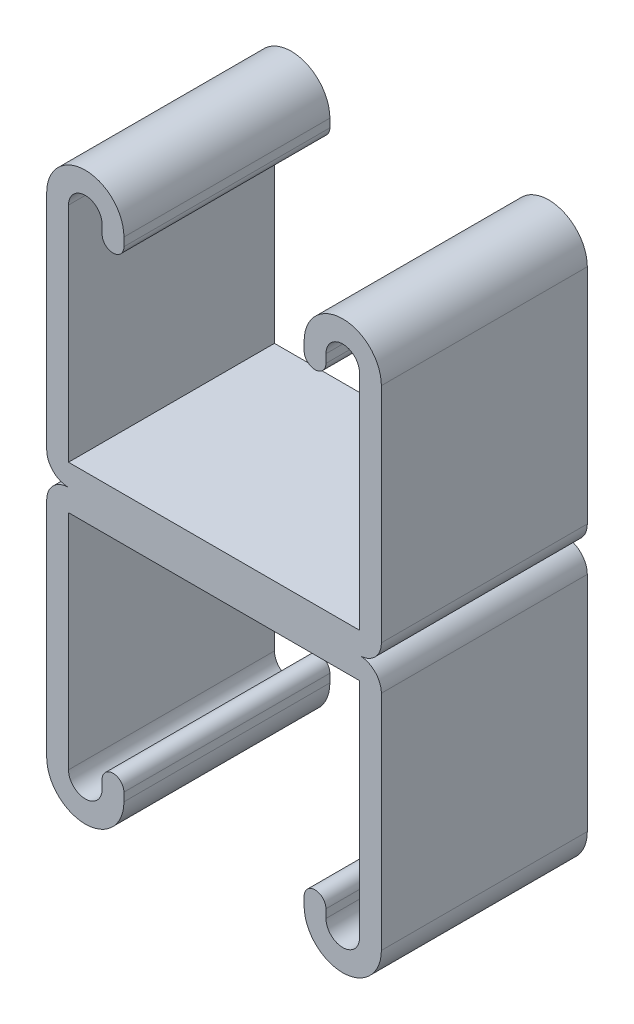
ISO-10303-21;
HEADER;
FILE_DESCRIPTION(('STEP AP214'),'2;1');
FILE_NAME('part.step','',(''),(''),'','','');
FILE_SCHEMA(('AUTOMOTIVE_DESIGN { 1 0 10303 214 1 1 1 1 }'));
ENDSEC;
DATA;
#1=APPLICATION_CONTEXT('core data for automotive mechanical design processes');
#2=APPLICATION_PROTOCOL_DEFINITION('international standard','automotive_design',2000,#1);
#3=PRODUCT_CONTEXT('',#1,'mechanical');
#4=PRODUCT('Part','Part','',(#3));
#5=PRODUCT_RELATED_PRODUCT_CATEGORY('part','',(#4));
#6=PRODUCT_DEFINITION_FORMATION('','',#4);
#7=PRODUCT_DEFINITION_CONTEXT('part definition',#1,'design');
#8=PRODUCT_DEFINITION('design','',#6,#7);
#9=PRODUCT_DEFINITION_SHAPE('','',#8);
#10=(LENGTH_UNIT() NAMED_UNIT(*) SI_UNIT(.MILLI.,.METRE.));
#11=(NAMED_UNIT(*) PLANE_ANGLE_UNIT() SI_UNIT($,.RADIAN.));
#12=(NAMED_UNIT(*) SI_UNIT($,.STERADIAN.) SOLID_ANGLE_UNIT());
#13=UNCERTAINTY_MEASURE_WITH_UNIT(LENGTH_MEASURE(1.E-05),#10,'distance_accuracy_value','');
#14=(GEOMETRIC_REPRESENTATION_CONTEXT(3) GLOBAL_UNCERTAINTY_ASSIGNED_CONTEXT((#13)) GLOBAL_UNIT_ASSIGNED_CONTEXT((#10,
#11,#12)) REPRESENTATION_CONTEXT('',''));
#15=CARTESIAN_POINT('',(0.,0.,0.));
#16=DIRECTION('',(0.,0.,1.));
#17=DIRECTION('',(1.,0.,0.));
#18=AXIS2_PLACEMENT_3D('',#15,#16,#17);
#19=CARTESIAN_POINT('',(-15.875,30.1625,12.7));
#20=DIRECTION('',(0.,0.,-1.));
#21=DIRECTION('',(-1.,0.,0.));
#22=AXIS2_PLACEMENT_3D('',#19,#20,#21);
#23=CYLINDRICAL_SURFACE('',#22,4.7625);
#24=CARTESIAN_POINT('',(-15.875,30.1625,-12.7));
#25=DIRECTION('',(0.,0.,1.));
#26=DIRECTION('',(-1.,0.,0.));
#27=AXIS2_PLACEMENT_3D('',#24,#25,#26);
#28=CIRCLE('',#27,4.7625);
#29=CARTESIAN_POINT('',(-11.1125,30.1625,-12.7));
#30=VERTEX_POINT('',#29);
#31=CARTESIAN_POINT('',(-20.6375,30.1625,-12.7));
#32=VERTEX_POINT('',#31);
#33=EDGE_CURVE('E196',#30,#32,#28,.T.);
#34=ORIENTED_EDGE('',*,*,#33,.T.);
#35=DIRECTION('',(0.,0.,-1.));
#36=VECTOR('',#35,1.);
#37=CARTESIAN_POINT('',(-20.6375,30.1625,12.7));
#38=LINE('',#37,#36);
#39=CARTESIAN_POINT('',(-20.6375,30.1625,12.7));
#40=VERTEX_POINT('',#39);
#41=EDGE_CURVE('E11',#40,#32,#38,.T.);
#42=ORIENTED_EDGE('',*,*,#41,.F.);
#43=CARTESIAN_POINT('',(-15.875,30.1625,12.7));
#44=DIRECTION('',(0.,0.,1.));
#45=DIRECTION('',(-1.,0.,0.));
#46=AXIS2_PLACEMENT_3D('',#43,#44,#45);
#47=CIRCLE('',#46,4.7625);
#48=CARTESIAN_POINT('',(-11.1125,30.1625,12.7));
#49=VERTEX_POINT('',#48);
#50=EDGE_CURVE('E229',#49,#40,#47,.T.);
#51=ORIENTED_EDGE('',*,*,#50,.F.);
#52=DIRECTION('',(0.,0.,-1.));
#53=VECTOR('',#52,1.);
#54=CARTESIAN_POINT('',(-11.1125,30.1625,12.7));
#55=LINE('',#54,#53);
#56=EDGE_CURVE('E192',#49,#30,#55,.T.);
#57=ORIENTED_EDGE('',*,*,#56,.T.);
#58=EDGE_LOOP('',(#34,#42,#51,#57));
#59=FACE_BOUND('',#58,.T.);
#60=ADVANCED_FACE('F39',(#59),#23,.T.);
#61=CARTESIAN_POINT('',(-20.6375,30.1625,12.7));
#62=DIRECTION('',(1.,0.,0.));
#63=DIRECTION('',(0.,1.,0.));
#64=AXIS2_PLACEMENT_3D('',#61,#62,#63);
#65=PLANE('',#64);
#66=DIRECTION('',(0.,-1.,0.));
#67=VECTOR('',#66,1.);
#68=CARTESIAN_POINT('',(-20.6375,30.1625,-12.7));
#69=LINE('',#68,#67);
#70=CARTESIAN_POINT('',(-20.6375,2.6924,-12.7));
#71=VERTEX_POINT('',#70);
#72=EDGE_CURVE('E199',#32,#71,#69,.T.);
#73=ORIENTED_EDGE('',*,*,#72,.T.);
#74=DIRECTION('',(0.,0.,-1.));
#75=VECTOR('',#74,1.);
#76=CARTESIAN_POINT('',(-20.6375,2.6924,12.7));
#77=LINE('',#76,#75);
#78=CARTESIAN_POINT('',(-20.6375,2.6924,12.7));
#79=VERTEX_POINT('',#78);
#80=EDGE_CURVE('E47',#79,#71,#77,.T.);
#81=ORIENTED_EDGE('',*,*,#80,.F.);
#82=DIRECTION('',(0.,-1.,0.));
#83=VECTOR('',#82,1.);
#84=CARTESIAN_POINT('',(-20.6375,30.1625,12.7));
#85=LINE('',#84,#83);
#86=EDGE_CURVE('E126',#40,#79,#85,.T.);
#87=ORIENTED_EDGE('',*,*,#86,.F.);
#88=ORIENTED_EDGE('',*,*,#41,.T.);
#89=EDGE_LOOP('',(#73,#81,#87,#88));
#90=FACE_BOUND('',#89,.T.);
#91=ADVANCED_FACE('F392',(#90),#65,.F.);
#92=CARTESIAN_POINT('',(-17.9451,2.6924,12.7));
#93=DIRECTION('',(0.,0.,-1.));
#94=DIRECTION('',(-1.,0.,0.));
#95=AXIS2_PLACEMENT_3D('',#92,#93,#94);
#96=CYLINDRICAL_SURFACE('',#95,2.6924);
#97=CARTESIAN_POINT('',(-17.9451,2.6924,-12.7));
#98=DIRECTION('',(0.,0.,1.));
#99=DIRECTION('',(-1.,0.,0.));
#100=AXIS2_PLACEMENT_3D('',#97,#98,#99);
#101=CIRCLE('',#100,2.6924);
#102=CARTESIAN_POINT('',(-17.9451,0.,-12.7));
#103=VERTEX_POINT('',#102);
#104=EDGE_CURVE('E202',#71,#103,#101,.T.);
#105=ORIENTED_EDGE('',*,*,#104,.T.);
#106=DIRECTION('',(0.,0.,-1.));
#107=VECTOR('',#106,1.);
#108=CARTESIAN_POINT('',(-17.9451,0.,12.7));
#109=LINE('',#108,#107);
#110=CARTESIAN_POINT('',(-17.9451,0.,12.7));
#111=VERTEX_POINT('',#110);
#112=EDGE_CURVE('E266',#111,#103,#109,.T.);
#113=ORIENTED_EDGE('',*,*,#112,.F.);
#114=CARTESIAN_POINT('',(-17.9451,2.6924,12.7));
#115=DIRECTION('',(0.,0.,1.));
#116=DIRECTION('',(-1.,0.,0.));
#117=AXIS2_PLACEMENT_3D('',#114,#115,#116);
#118=CIRCLE('',#117,2.6924);
#119=EDGE_CURVE('E274',#79,#111,#118,.T.);
#120=ORIENTED_EDGE('',*,*,#119,.F.);
#121=ORIENTED_EDGE('',*,*,#80,.T.);
#122=EDGE_LOOP('',(#105,#113,#120,#121));
#123=FACE_BOUND('',#122,.T.);
#124=ADVANCED_FACE('F272',(#123),#96,.T.);
#125=CARTESIAN_POINT('',(17.9451,2.69240000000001,12.7));
#126=DIRECTION('',(0.,0.,-1.));
#127=DIRECTION('',(-1.,0.,0.));
#128=AXIS2_PLACEMENT_3D('',#125,#126,#127);
#129=CYLINDRICAL_SURFACE('',#128,2.6924);
#130=CARTESIAN_POINT('',(17.9451,2.69240000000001,-12.7));
#131=DIRECTION('',(0.,0.,1.));
#132=DIRECTION('',(1.,0.,0.));
#133=AXIS2_PLACEMENT_3D('',#130,#131,#132);
#134=CIRCLE('',#133,2.6924);
#135=CARTESIAN_POINT('',(17.9451,0.,-12.7));
#136=VERTEX_POINT('',#135);
#137=CARTESIAN_POINT('',(20.6375,2.69240000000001,-12.7));
#138=VERTEX_POINT('',#137);
#139=EDGE_CURVE('E204',#136,#138,#134,.T.);
#140=ORIENTED_EDGE('',*,*,#139,.T.);
#141=DIRECTION('',(0.,0.,-1.));
#142=VECTOR('',#141,1.);
#143=CARTESIAN_POINT('',(20.6375,2.69240000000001,12.7));
#144=LINE('',#143,#142);
#145=CARTESIAN_POINT('',(20.6375,2.69240000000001,12.7));
#146=VERTEX_POINT('',#145);
#147=EDGE_CURVE('E260',#146,#138,#144,.T.);
#148=ORIENTED_EDGE('',*,*,#147,.F.);
#149=CARTESIAN_POINT('',(17.9451,2.69240000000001,12.7));
#150=DIRECTION('',(0.,0.,1.));
#151=DIRECTION('',(1.,0.,0.));
#152=AXIS2_PLACEMENT_3D('',#149,#150,#151);
#153=CIRCLE('',#152,2.6924);
#154=CARTESIAN_POINT('',(17.9451,0.,12.7));
#155=VERTEX_POINT('',#154);
#156=EDGE_CURVE('E348',#155,#146,#153,.T.);
#157=ORIENTED_EDGE('',*,*,#156,.F.);
#158=DIRECTION('',(0.,0.,-1.));
#159=VECTOR('',#158,1.);
#160=CARTESIAN_POINT('',(17.9451,0.,12.7));
#161=LINE('',#160,#159);
#162=EDGE_CURVE('E263',#155,#136,#161,.T.);
#163=ORIENTED_EDGE('',*,*,#162,.T.);
#164=EDGE_LOOP('',(#140,#148,#157,#163));
#165=FACE_BOUND('',#164,.T.);
#166=ADVANCED_FACE('F399',(#165),#129,.T.);
#167=CARTESIAN_POINT('',(20.6375,2.69240000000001,12.7));
#168=DIRECTION('',(-1.,0.,0.));
#169=DIRECTION('',(0.,-1.,0.));
#170=AXIS2_PLACEMENT_3D('',#167,#168,#169);
#171=PLANE('',#170);
#172=DIRECTION('',(0.,1.,0.));
#173=VECTOR('',#172,1.);
#174=CARTESIAN_POINT('',(20.6375,2.69240000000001,-12.7));
#175=LINE('',#174,#173);
#176=CARTESIAN_POINT('',(20.6375,30.1625,-12.7));
#177=VERTEX_POINT('',#176);
#178=EDGE_CURVE('E206',#138,#177,#175,.T.);
#179=ORIENTED_EDGE('',*,*,#178,.T.);
#180=DIRECTION('',(0.,0.,-1.));
#181=VECTOR('',#180,1.);
#182=CARTESIAN_POINT('',(20.6375,30.1625,12.7));
#183=LINE('',#182,#181);
#184=CARTESIAN_POINT('',(20.6375,30.1625,12.7));
#185=VERTEX_POINT('',#184);
#186=EDGE_CURVE('E257',#185,#177,#183,.T.);
#187=ORIENTED_EDGE('',*,*,#186,.F.);
#188=DIRECTION('',(0.,1.,0.));
#189=VECTOR('',#188,1.);
#190=CARTESIAN_POINT('',(20.6375,2.69240000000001,12.7));
#191=LINE('',#190,#189);
#192=EDGE_CURVE('E350',#146,#185,#191,.T.);
#193=ORIENTED_EDGE('',*,*,#192,.F.);
#194=ORIENTED_EDGE('',*,*,#147,.T.);
#195=EDGE_LOOP('',(#179,#187,#193,#194));
#196=FACE_BOUND('',#195,.T.);
#197=ADVANCED_FACE('F404',(#196),#171,.F.);
#198=CARTESIAN_POINT('',(15.875,30.1625,12.7));
#199=DIRECTION('',(0.,0.,-1.));
#200=DIRECTION('',(-1.,0.,0.));
#201=AXIS2_PLACEMENT_3D('',#198,#199,#200);
#202=CYLINDRICAL_SURFACE('',#201,4.7625);
#203=CARTESIAN_POINT('',(15.875,30.1625,-12.7));
#204=DIRECTION('',(0.,0.,1.));
#205=DIRECTION('',(1.,0.,0.));
#206=AXIS2_PLACEMENT_3D('',#203,#204,#205);
#207=CIRCLE('',#206,4.7625);
#208=CARTESIAN_POINT('',(11.1125,30.1625,-12.7));
#209=VERTEX_POINT('',#208);
#210=EDGE_CURVE('E208',#177,#209,#207,.T.);
#211=ORIENTED_EDGE('',*,*,#210,.T.);
#212=DIRECTION('',(0.,0.,-1.));
#213=VECTOR('',#212,1.);
#214=CARTESIAN_POINT('',(11.1125,30.1625,12.7));
#215=LINE('',#214,#213);
#216=CARTESIAN_POINT('',(11.1125,30.1625,12.7));
#217=VERTEX_POINT('',#216);
#218=EDGE_CURVE('E254',#217,#209,#215,.T.);
#219=ORIENTED_EDGE('',*,*,#218,.F.);
#220=CARTESIAN_POINT('',(15.875,30.1625,12.7));
#221=DIRECTION('',(0.,0.,1.));
#222=DIRECTION('',(1.,0.,0.));
#223=AXIS2_PLACEMENT_3D('',#220,#221,#222);
#224=CIRCLE('',#223,4.7625);
#225=EDGE_CURVE('E352',#185,#217,#224,.T.);
#226=ORIENTED_EDGE('',*,*,#225,.F.);
#227=ORIENTED_EDGE('',*,*,#186,.T.);
#228=EDGE_LOOP('',(#211,#219,#226,#227));
#229=FACE_BOUND('',#228,.T.);
#230=ADVANCED_FACE('F407',(#229),#202,.T.);
#231=CARTESIAN_POINT('',(11.1125,30.1625,12.7));
#232=DIRECTION('',(1.,0.,0.));
#233=DIRECTION('',(0.,1.,0.));
#234=AXIS2_PLACEMENT_3D('',#231,#232,#233);
#235=PLANE('',#234);
#236=DIRECTION('',(0.,-1.,0.));
#237=VECTOR('',#236,1.);
#238=CARTESIAN_POINT('',(11.1125,30.1625,-12.7));
#239=LINE('',#238,#237);
#240=CARTESIAN_POINT('',(11.1125,29.12745,-12.7));
#241=VERTEX_POINT('',#240);
#242=EDGE_CURVE('E210',#209,#241,#239,.T.);
#243=ORIENTED_EDGE('',*,*,#242,.T.);
#244=DIRECTION('',(0.,0.,-1.));
#245=VECTOR('',#244,1.);
#246=CARTESIAN_POINT('',(11.1125,29.12745,12.7));
#247=LINE('',#246,#245);
#248=CARTESIAN_POINT('',(11.1125,29.12745,12.7));
#249=VERTEX_POINT('',#248);
#250=EDGE_CURVE('E251',#249,#241,#247,.T.);
#251=ORIENTED_EDGE('',*,*,#250,.F.);
#252=DIRECTION('',(0.,-1.,0.));
#253=VECTOR('',#252,1.);
#254=CARTESIAN_POINT('',(11.1125,30.1625,12.7));
#255=LINE('',#254,#253);
#256=EDGE_CURVE('E354',#217,#249,#255,.T.);
#257=ORIENTED_EDGE('',*,*,#256,.F.);
#258=ORIENTED_EDGE('',*,*,#218,.T.);
#259=EDGE_LOOP('',(#243,#251,#257,#258));
#260=FACE_BOUND('',#259,.T.);
#261=ADVANCED_FACE('F411',(#260),#235,.F.);
#262=CARTESIAN_POINT('',(12.4587,29.12745,12.7));
#263=DIRECTION('',(0.,0.,-1.));
#264=DIRECTION('',(-1.,0.,0.));
#265=AXIS2_PLACEMENT_3D('',#262,#263,#264);
#266=CYLINDRICAL_SURFACE('',#265,1.3462);
#267=CARTESIAN_POINT('',(12.4587,29.12745,-12.7));
#268=DIRECTION('',(0.,0.,1.));
#269=DIRECTION('',(1.,0.,0.));
#270=AXIS2_PLACEMENT_3D('',#267,#268,#269);
#271=CIRCLE('',#270,1.3462);
#272=CARTESIAN_POINT('',(13.8049,29.12745,-12.7));
#273=VERTEX_POINT('',#272);
#274=EDGE_CURVE('E212',#241,#273,#271,.T.);
#275=ORIENTED_EDGE('',*,*,#274,.T.);
#276=DIRECTION('',(0.,0.,-1.));
#277=VECTOR('',#276,1.);
#278=CARTESIAN_POINT('',(13.8049,29.12745,12.7));
#279=LINE('',#278,#277);
#280=CARTESIAN_POINT('',(13.8049,29.12745,12.7));
#281=VERTEX_POINT('',#280);
#282=EDGE_CURVE('E248',#281,#273,#279,.T.);
#283=ORIENTED_EDGE('',*,*,#282,.F.);
#284=CARTESIAN_POINT('',(12.4587,29.12745,12.7));
#285=DIRECTION('',(0.,0.,1.));
#286=DIRECTION('',(1.,0.,0.));
#287=AXIS2_PLACEMENT_3D('',#284,#285,#286);
#288=CIRCLE('',#287,1.3462);
#289=EDGE_CURVE('E356',#249,#281,#288,.T.);
#290=ORIENTED_EDGE('',*,*,#289,.F.);
#291=ORIENTED_EDGE('',*,*,#250,.T.);
#292=EDGE_LOOP('',(#275,#283,#290,#291));
#293=FACE_BOUND('',#292,.T.);
#294=ADVANCED_FACE('F415',(#293),#266,.T.);
#295=CARTESIAN_POINT('',(13.8049,30.1625,12.7));
#296=DIRECTION('',(-1.,0.,0.));
#297=DIRECTION('',(0.,0.,1.));
#298=AXIS2_PLACEMENT_3D('',#295,#296,#297);
#299=PLANE('',#298);
#300=DIRECTION('',(0.,1.,0.));
#301=VECTOR('',#300,1.);
#302=CARTESIAN_POINT('',(13.8049,30.1625,-12.7));
#303=LINE('',#302,#301);
#304=CARTESIAN_POINT('',(13.8049,30.1625,-12.7));
#305=VERTEX_POINT('',#304);
#306=EDGE_CURVE('E214',#273,#305,#303,.T.);
#307=ORIENTED_EDGE('',*,*,#306,.T.);
#308=DIRECTION('',(0.,0.,-1.));
#309=VECTOR('',#308,1.);
#310=CARTESIAN_POINT('',(13.8049,30.1625,12.7));
#311=LINE('',#310,#309);
#312=CARTESIAN_POINT('',(13.8049,30.1625,12.7));
#313=VERTEX_POINT('',#312);
#314=EDGE_CURVE('E245',#313,#305,#311,.T.);
#315=ORIENTED_EDGE('',*,*,#314,.F.);
#316=DIRECTION('',(0.,1.,0.));
#317=VECTOR('',#316,1.);
#318=CARTESIAN_POINT('',(13.8049,30.1625,12.7));
#319=LINE('',#318,#317);
#320=EDGE_CURVE('E358',#281,#313,#319,.T.);
#321=ORIENTED_EDGE('',*,*,#320,.F.);
#322=ORIENTED_EDGE('',*,*,#282,.T.);
#323=EDGE_LOOP('',(#307,#315,#321,#322));
#324=FACE_BOUND('',#323,.T.);
#325=ADVANCED_FACE('F419',(#324),#299,.F.);
#326=CARTESIAN_POINT('',(15.875,30.1625,12.7));
#327=DIRECTION('',(0.,0.,-1.));
#328=DIRECTION('',(-1.,0.,0.));
#329=AXIS2_PLACEMENT_3D('',#326,#327,#328);
#330=CYLINDRICAL_SURFACE('',#329,2.0701);
#331=CARTESIAN_POINT('',(15.875,30.1625,-12.7));
#332=DIRECTION('',(0.,0.,-1.));
#333=DIRECTION('',(1.,0.,0.));
#334=AXIS2_PLACEMENT_3D('',#331,#332,#333);
#335=CIRCLE('',#334,2.0701);
#336=CARTESIAN_POINT('',(17.9451,30.1625,-12.7));
#337=VERTEX_POINT('',#336);
#338=EDGE_CURVE('E216',#305,#337,#335,.T.);
#339=ORIENTED_EDGE('',*,*,#338,.T.);
#340=DIRECTION('',(0.,0.,-1.));
#341=VECTOR('',#340,1.);
#342=CARTESIAN_POINT('',(17.9451,30.1625,12.7));
#343=LINE('',#342,#341);
#344=CARTESIAN_POINT('',(17.9451,30.1625,12.7));
#345=VERTEX_POINT('',#344);
#346=EDGE_CURVE('E242',#345,#337,#343,.T.);
#347=ORIENTED_EDGE('',*,*,#346,.F.);
#348=CARTESIAN_POINT('',(15.875,30.1625,12.7));
#349=DIRECTION('',(0.,0.,-1.));
#350=DIRECTION('',(1.,0.,0.));
#351=AXIS2_PLACEMENT_3D('',#348,#349,#350);
#352=CIRCLE('',#351,2.0701);
#353=EDGE_CURVE('E360',#313,#345,#352,.T.);
#354=ORIENTED_EDGE('',*,*,#353,.F.);
#355=ORIENTED_EDGE('',*,*,#314,.T.);
#356=EDGE_LOOP('',(#339,#347,#354,#355));
#357=FACE_BOUND('',#356,.T.);
#358=ADVANCED_FACE('F423',(#357),#330,.F.);
#359=CARTESIAN_POINT('',(17.9451,2.6924,12.7));
#360=DIRECTION('',(1.,0.,0.));
#361=DIRECTION('',(0.,0.,-1.));
#362=AXIS2_PLACEMENT_3D('',#359,#360,#361);
#363=PLANE('',#362);
#364=DIRECTION('',(0.,-1.,0.));
#365=VECTOR('',#364,1.);
#366=CARTESIAN_POINT('',(17.9451,2.6924,-12.7));
#367=LINE('',#366,#365);
#368=CARTESIAN_POINT('',(17.9451,2.6924,-12.7));
#369=VERTEX_POINT('',#368);
#370=EDGE_CURVE('E218',#337,#369,#367,.T.);
#371=ORIENTED_EDGE('',*,*,#370,.T.);
#372=DIRECTION('',(0.,0.,-1.));
#373=VECTOR('',#372,1.);
#374=CARTESIAN_POINT('',(17.9451,2.6924,12.7));
#375=LINE('',#374,#373);
#376=CARTESIAN_POINT('',(17.9451,2.6924,12.7));
#377=VERTEX_POINT('',#376);
#378=EDGE_CURVE('E239',#377,#369,#375,.T.);
#379=ORIENTED_EDGE('',*,*,#378,.F.);
#380=DIRECTION('',(0.,-1.,0.));
#381=VECTOR('',#380,1.);
#382=CARTESIAN_POINT('',(17.9451,2.6924,12.7));
#383=LINE('',#382,#381);
#384=EDGE_CURVE('E362',#345,#377,#383,.T.);
#385=ORIENTED_EDGE('',*,*,#384,.F.);
#386=ORIENTED_EDGE('',*,*,#346,.T.);
#387=EDGE_LOOP('',(#371,#379,#385,#386));
#388=FACE_BOUND('',#387,.T.);
#389=ADVANCED_FACE('F427',(#388),#363,.F.);
#390=CARTESIAN_POINT('',(-17.9451,2.6924,12.7));
#391=DIRECTION('',(0.,-1.,0.));
#392=DIRECTION('',(0.,0.,-1.));
#393=AXIS2_PLACEMENT_3D('',#390,#391,#392);
#394=PLANE('',#393);
#395=DIRECTION('',(-1.,0.,0.));
#396=VECTOR('',#395,1.);
#397=CARTESIAN_POINT('',(-17.9451,2.6924,-12.7));
#398=LINE('',#397,#396);
#399=CARTESIAN_POINT('',(-17.9451,2.6924,-12.7));
#400=VERTEX_POINT('',#399);
#401=EDGE_CURVE('E220',#369,#400,#398,.T.);
#402=ORIENTED_EDGE('',*,*,#401,.T.);
#403=DIRECTION('',(0.,0.,-1.));
#404=VECTOR('',#403,1.);
#405=CARTESIAN_POINT('',(-17.9451,2.6924,12.7));
#406=LINE('',#405,#404);
#407=CARTESIAN_POINT('',(-17.9451,2.6924,12.7));
#408=VERTEX_POINT('',#407);
#409=EDGE_CURVE('E236',#408,#400,#406,.T.);
#410=ORIENTED_EDGE('',*,*,#409,.F.);
#411=DIRECTION('',(-1.,0.,0.));
#412=VECTOR('',#411,1.);
#413=CARTESIAN_POINT('',(-17.9451,2.6924,12.7));
#414=LINE('',#413,#412);
#415=EDGE_CURVE('E364',#377,#408,#414,.T.);
#416=ORIENTED_EDGE('',*,*,#415,.F.);
#417=ORIENTED_EDGE('',*,*,#378,.T.);
#418=EDGE_LOOP('',(#402,#410,#416,#417));
#419=FACE_BOUND('',#418,.T.);
#420=ADVANCED_FACE('F431',(#419),#394,.F.);
#421=CARTESIAN_POINT('',(-17.9451,30.1625,12.7));
#422=DIRECTION('',(-1.,0.,0.));
#423=DIRECTION('',(0.,-1.,0.));
#424=AXIS2_PLACEMENT_3D('',#421,#422,#423);
#425=PLANE('',#424);
#426=DIRECTION('',(0.,1.,0.));
#427=VECTOR('',#426,1.);
#428=CARTESIAN_POINT('',(-17.9451,30.1625,-12.7));
#429=LINE('',#428,#427);
#430=CARTESIAN_POINT('',(-17.9451,30.1625,-12.7));
#431=VERTEX_POINT('',#430);
#432=EDGE_CURVE('E222',#400,#431,#429,.T.);
#433=ORIENTED_EDGE('',*,*,#432,.T.);
#434=DIRECTION('',(0.,0.,-1.));
#435=VECTOR('',#434,1.);
#436=CARTESIAN_POINT('',(-17.9451,30.1625,12.7));
#437=LINE('',#436,#435);
#438=CARTESIAN_POINT('',(-17.9451,30.1625,12.7));
#439=VERTEX_POINT('',#438);
#440=EDGE_CURVE('E233',#439,#431,#437,.T.);
#441=ORIENTED_EDGE('',*,*,#440,.F.);
#442=DIRECTION('',(0.,1.,0.));
#443=VECTOR('',#442,1.);
#444=CARTESIAN_POINT('',(-17.9451,30.1625,12.7));
#445=LINE('',#444,#443);
#446=EDGE_CURVE('E366',#408,#439,#445,.T.);
#447=ORIENTED_EDGE('',*,*,#446,.F.);
#448=ORIENTED_EDGE('',*,*,#409,.T.);
#449=EDGE_LOOP('',(#433,#441,#447,#448));
#450=FACE_BOUND('',#449,.T.);
#451=ADVANCED_FACE('F372',(#450),#425,.F.);
#452=CARTESIAN_POINT('',(-15.875,30.1625,12.7));
#453=DIRECTION('',(0.,0.,-1.));
#454=DIRECTION('',(-1.,0.,0.));
#455=AXIS2_PLACEMENT_3D('',#452,#453,#454);
#456=CYLINDRICAL_SURFACE('',#455,2.0701);
#457=CARTESIAN_POINT('',(-15.875,30.1625,-12.7));
#458=DIRECTION('',(0.,0.,-1.));
#459=DIRECTION('',(-1.,0.,0.));
#460=AXIS2_PLACEMENT_3D('',#457,#458,#459);
#461=CIRCLE('',#460,2.0701);
#462=CARTESIAN_POINT('',(-13.8049,30.1625,-12.7));
#463=VERTEX_POINT('',#462);
#464=EDGE_CURVE('E224',#431,#463,#461,.T.);
#465=ORIENTED_EDGE('',*,*,#464,.T.);
#466=DIRECTION('',(0.,0.,-1.));
#467=VECTOR('',#466,1.);
#468=CARTESIAN_POINT('',(-13.8049,30.1625,12.7));
#469=LINE('',#468,#467);
#470=CARTESIAN_POINT('',(-13.8049,30.1625,12.7));
#471=VERTEX_POINT('',#470);
#472=EDGE_CURVE('E187',#471,#463,#469,.T.);
#473=ORIENTED_EDGE('',*,*,#472,.F.);
#474=CARTESIAN_POINT('',(-15.875,30.1625,12.7));
#475=DIRECTION('',(0.,0.,-1.));
#476=DIRECTION('',(-1.,0.,0.));
#477=AXIS2_PLACEMENT_3D('',#474,#475,#476);
#478=CIRCLE('',#477,2.0701);
#479=EDGE_CURVE('E178',#439,#471,#478,.T.);
#480=ORIENTED_EDGE('',*,*,#479,.F.);
#481=ORIENTED_EDGE('',*,*,#440,.T.);
#482=EDGE_LOOP('',(#465,#473,#480,#481));
#483=FACE_BOUND('',#482,.T.);
#484=ADVANCED_FACE('F376',(#483),#456,.F.);
#485=CARTESIAN_POINT('',(-13.8049,30.1625,12.7));
#486=DIRECTION('',(1.,0.,0.));
#487=DIRECTION('',(0.,0.,-1.));
#488=AXIS2_PLACEMENT_3D('',#485,#486,#487);
#489=PLANE('',#488);
#490=DIRECTION('',(0.,-1.,0.));
#491=VECTOR('',#490,1.);
#492=CARTESIAN_POINT('',(-13.8049,30.1625,-12.7));
#493=LINE('',#492,#491);
#494=CARTESIAN_POINT('',(-13.8049,29.12745,-12.7));
#495=VERTEX_POINT('',#494);
#496=EDGE_CURVE('E186',#463,#495,#493,.T.);
#497=ORIENTED_EDGE('',*,*,#496,.T.);
#498=DIRECTION('',(0.,0.,-1.));
#499=VECTOR('',#498,1.);
#500=CARTESIAN_POINT('',(-13.8049,29.12745,12.7));
#501=LINE('',#500,#499);
#502=CARTESIAN_POINT('',(-13.8049,29.12745,12.7));
#503=VERTEX_POINT('',#502);
#504=EDGE_CURVE('E183',#503,#495,#501,.T.);
#505=ORIENTED_EDGE('',*,*,#504,.F.);
#506=DIRECTION('',(0.,-1.,0.));
#507=VECTOR('',#506,1.);
#508=CARTESIAN_POINT('',(-13.8049,30.1625,12.7));
#509=LINE('',#508,#507);
#510=EDGE_CURVE('E172',#471,#503,#509,.T.);
#511=ORIENTED_EDGE('',*,*,#510,.F.);
#512=ORIENTED_EDGE('',*,*,#472,.T.);
#513=EDGE_LOOP('',(#497,#505,#511,#512));
#514=FACE_BOUND('',#513,.T.);
#515=ADVANCED_FACE('F184',(#514),#489,.F.);
#516=CARTESIAN_POINT('',(-12.4587,29.12745,12.7));
#517=DIRECTION('',(0.,0.,-1.));
#518=DIRECTION('',(-1.,0.,0.));
#519=AXIS2_PLACEMENT_3D('',#516,#517,#518);
#520=CYLINDRICAL_SURFACE('',#519,1.3462);
#521=CARTESIAN_POINT('',(-12.4587,29.12745,-12.7));
#522=DIRECTION('',(0.,0.,1.));
#523=DIRECTION('',(-1.,0.,0.));
#524=AXIS2_PLACEMENT_3D('',#521,#522,#523);
#525=CIRCLE('',#524,1.3462);
#526=CARTESIAN_POINT('',(-11.1125,29.12745,-12.7));
#527=VERTEX_POINT('',#526);
#528=EDGE_CURVE('E112',#495,#527,#525,.T.);
#529=ORIENTED_EDGE('',*,*,#528,.T.);
#530=DIRECTION('',(0.,0.,-1.));
#531=VECTOR('',#530,1.);
#532=CARTESIAN_POINT('',(-11.1125,29.12745,12.7));
#533=LINE('',#532,#531);
#534=CARTESIAN_POINT('',(-11.1125,29.12745,12.7));
#535=VERTEX_POINT('',#534);
#536=EDGE_CURVE('E188',#535,#527,#533,.T.);
#537=ORIENTED_EDGE('',*,*,#536,.F.);
#538=CARTESIAN_POINT('',(-12.4587,29.12745,12.7));
#539=DIRECTION('',(0.,0.,1.));
#540=DIRECTION('',(-1.,0.,0.));
#541=AXIS2_PLACEMENT_3D('',#538,#539,#540);
#542=CIRCLE('',#541,1.3462);
#543=EDGE_CURVE('E176',#503,#535,#542,.T.);
#544=ORIENTED_EDGE('',*,*,#543,.F.);
#545=ORIENTED_EDGE('',*,*,#504,.T.);
#546=EDGE_LOOP('',(#529,#537,#544,#545));
#547=FACE_BOUND('',#546,.T.);
#548=ADVANCED_FACE('F190',(#547),#520,.T.);
#549=CARTESIAN_POINT('',(-11.1125,30.1625,12.7));
#550=DIRECTION('',(-1.,0.,0.));
#551=DIRECTION('',(0.,-1.,0.));
#552=AXIS2_PLACEMENT_3D('',#549,#550,#551);
#553=PLANE('',#552);
#554=DIRECTION('',(0.,1.,0.));
#555=VECTOR('',#554,1.);
#556=CARTESIAN_POINT('',(-11.1125,30.1625,-12.7));
#557=LINE('',#556,#555);
#558=EDGE_CURVE('E118',#527,#30,#557,.T.);
#559=ORIENTED_EDGE('',*,*,#558,.T.);
#560=ORIENTED_EDGE('',*,*,#56,.F.);
#561=DIRECTION('',(0.,1.,0.));
#562=VECTOR('',#561,1.);
#563=CARTESIAN_POINT('',(-11.1125,30.1625,12.7));
#564=LINE('',#563,#562);
#565=EDGE_CURVE('E55',#535,#49,#564,.T.);
#566=ORIENTED_EDGE('',*,*,#565,.F.);
#567=ORIENTED_EDGE('',*,*,#536,.T.);
#568=EDGE_LOOP('',(#559,#560,#566,#567));
#569=FACE_BOUND('',#568,.T.);
#570=ADVANCED_FACE('F380',(#569),#553,.F.);
#571=CARTESIAN_POINT('',(-15.875,30.1625,12.7));
#572=DIRECTION('',(0.,0.,-1.));
#573=DIRECTION('',(-1.,0.,0.));
#574=AXIS2_PLACEMENT_3D('',#571,#572,#573);
#575=PLANE('',#574);
#576=ORIENTED_EDGE('',*,*,#50,.T.);
#577=ORIENTED_EDGE('',*,*,#86,.T.);
#578=ORIENTED_EDGE('',*,*,#119,.T.);
#579=CARTESIAN_POINT('',(-17.9451,-2.6924,12.7));
#580=DIRECTION('',(0.,0.,-1.));
#581=DIRECTION('',(-1.,0.,0.));
#582=AXIS2_PLACEMENT_3D('',#579,#580,#581);
#583=CIRCLE('',#582,2.6924);
#584=CARTESIAN_POINT('',(-20.6375,-2.6924,12.7));
#585=VERTEX_POINT('',#584);
#586=EDGE_CURVE('E779',#585,#111,#583,.T.);
#587=ORIENTED_EDGE('',*,*,#586,.F.);
#588=DIRECTION('',(0.,1.,0.));
#589=VECTOR('',#588,1.);
#590=CARTESIAN_POINT('',(-20.6375,-30.1625,12.7));
#591=LINE('',#590,#589);
#592=CARTESIAN_POINT('',(-20.6375,-30.1625,12.7));
#593=VERTEX_POINT('',#592);
#594=EDGE_CURVE('E301',#593,#585,#591,.T.);
#595=ORIENTED_EDGE('',*,*,#594,.F.);
#596=CARTESIAN_POINT('',(-15.875,-30.1625,12.7));
#597=DIRECTION('',(0.,0.,-1.));
#598=DIRECTION('',(-1.,0.,0.));
#599=AXIS2_PLACEMENT_3D('',#596,#597,#598);
#600=CIRCLE('',#599,4.7625);
#601=CARTESIAN_POINT('',(-11.1125,-30.1625,12.7));
#602=VERTEX_POINT('',#601);
#603=EDGE_CURVE('E290',#602,#593,#600,.T.);
#604=ORIENTED_EDGE('',*,*,#603,.F.);
#605=DIRECTION('',(0.,-1.,0.));
#606=VECTOR('',#605,1.);
#607=CARTESIAN_POINT('',(-11.1125,-30.1625,12.7));
#608=LINE('',#607,#606);
#609=CARTESIAN_POINT('',(-11.1125,-29.12745,12.7));
#610=VERTEX_POINT('',#609);
#611=EDGE_CURVE('E728',#610,#602,#608,.T.);
#612=ORIENTED_EDGE('',*,*,#611,.F.);
#613=CARTESIAN_POINT('',(-12.4587,-29.12745,12.7));
#614=DIRECTION('',(0.,0.,-1.));
#615=DIRECTION('',(-1.,0.,0.));
#616=AXIS2_PLACEMENT_3D('',#613,#614,#615);
#617=CIRCLE('',#616,1.3462);
#618=CARTESIAN_POINT('',(-13.8049,-29.12745,12.7));
#619=VERTEX_POINT('',#618);
#620=EDGE_CURVE('E737',#619,#610,#617,.T.);
#621=ORIENTED_EDGE('',*,*,#620,.F.);
#622=DIRECTION('',(0.,1.,0.));
#623=VECTOR('',#622,1.);
#624=CARTESIAN_POINT('',(-13.8049,-30.1625,12.7));
#625=LINE('',#624,#623);
#626=CARTESIAN_POINT('',(-13.8049,-30.1625,12.7));
#627=VERTEX_POINT('',#626);
#628=EDGE_CURVE('E741',#627,#619,#625,.T.);
#629=ORIENTED_EDGE('',*,*,#628,.F.);
#630=CARTESIAN_POINT('',(-15.875,-30.1625,12.7));
#631=DIRECTION('',(0.,0.,1.));
#632=DIRECTION('',(-1.,0.,0.));
#633=AXIS2_PLACEMENT_3D('',#630,#631,#632);
#634=CIRCLE('',#633,2.0701);
#635=CARTESIAN_POINT('',(-17.9451,-30.1625,12.7));
#636=VERTEX_POINT('',#635);
#637=EDGE_CURVE('E743',#636,#627,#634,.T.);
#638=ORIENTED_EDGE('',*,*,#637,.F.);
#639=DIRECTION('',(0.,-1.,0.));
#640=VECTOR('',#639,1.);
#641=CARTESIAN_POINT('',(-17.9451,-30.1625,12.7));
#642=LINE('',#641,#640);
#643=CARTESIAN_POINT('',(-17.9451,-2.6924,12.7));
#644=VERTEX_POINT('',#643);
#645=EDGE_CURVE('E749',#644,#636,#642,.T.);
#646=ORIENTED_EDGE('',*,*,#645,.F.);
#647=DIRECTION('',(-1.,0.,0.));
#648=VECTOR('',#647,1.);
#649=CARTESIAN_POINT('',(-17.9451,-2.6924,12.7));
#650=LINE('',#649,#648);
#651=CARTESIAN_POINT('',(17.9451,-2.6924,12.7));
#652=VERTEX_POINT('',#651);
#653=EDGE_CURVE('E752',#652,#644,#650,.T.);
#654=ORIENTED_EDGE('',*,*,#653,.F.);
#655=DIRECTION('',(0.,1.,0.));
#656=VECTOR('',#655,1.);
#657=CARTESIAN_POINT('',(17.9451,-2.6924,12.7));
#658=LINE('',#657,#656);
#659=CARTESIAN_POINT('',(17.9451,-30.1625,12.7));
#660=VERTEX_POINT('',#659);
#661=EDGE_CURVE('E755',#660,#652,#658,.T.);
#662=ORIENTED_EDGE('',*,*,#661,.F.);
#663=CARTESIAN_POINT('',(15.875,-30.1625,12.7));
#664=DIRECTION('',(0.,0.,1.));
#665=DIRECTION('',(1.,0.,0.));
#666=AXIS2_PLACEMENT_3D('',#663,#664,#665);
#667=CIRCLE('',#666,2.0701);
#668=CARTESIAN_POINT('',(13.8049,-30.1625,12.7));
#669=VERTEX_POINT('',#668);
#670=EDGE_CURVE('E758',#669,#660,#667,.T.);
#671=ORIENTED_EDGE('',*,*,#670,.F.);
#672=DIRECTION('',(0.,-1.,0.));
#673=VECTOR('',#672,1.);
#674=CARTESIAN_POINT('',(13.8049,-30.1625,12.7));
#675=LINE('',#674,#673);
#676=CARTESIAN_POINT('',(13.8049,-29.12745,12.7));
#677=VERTEX_POINT('',#676);
#678=EDGE_CURVE('E761',#677,#669,#675,.T.);
#679=ORIENTED_EDGE('',*,*,#678,.F.);
#680=CARTESIAN_POINT('',(12.4587,-29.12745,12.7));
#681=DIRECTION('',(0.,0.,-1.));
#682=DIRECTION('',(1.,0.,0.));
#683=AXIS2_PLACEMENT_3D('',#680,#681,#682);
#684=CIRCLE('',#683,1.3462);
#685=CARTESIAN_POINT('',(11.1125,-29.12745,12.7));
#686=VERTEX_POINT('',#685);
#687=EDGE_CURVE('E764',#686,#677,#684,.T.);
#688=ORIENTED_EDGE('',*,*,#687,.F.);
#689=DIRECTION('',(0.,1.,0.));
#690=VECTOR('',#689,1.);
#691=CARTESIAN_POINT('',(11.1125,-30.1625,12.7));
#692=LINE('',#691,#690);
#693=CARTESIAN_POINT('',(11.1125,-30.1625,12.7));
#694=VERTEX_POINT('',#693);
#695=EDGE_CURVE('E767',#694,#686,#692,.T.);
#696=ORIENTED_EDGE('',*,*,#695,.F.);
#697=CARTESIAN_POINT('',(15.875,-30.1625,12.7));
#698=DIRECTION('',(0.,0.,-1.));
#699=DIRECTION('',(1.,0.,0.));
#700=AXIS2_PLACEMENT_3D('',#697,#698,#699);
#701=CIRCLE('',#700,4.7625);
#702=CARTESIAN_POINT('',(20.6375,-30.1625,12.7));
#703=VERTEX_POINT('',#702);
#704=EDGE_CURVE('E770',#703,#694,#701,.T.);
#705=ORIENTED_EDGE('',*,*,#704,.F.);
#706=DIRECTION('',(0.,-1.,0.));
#707=VECTOR('',#706,1.);
#708=CARTESIAN_POINT('',(20.6375,-2.69240000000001,12.7));
#709=LINE('',#708,#707);
#710=CARTESIAN_POINT('',(20.6375,-2.69240000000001,12.7));
#711=VERTEX_POINT('',#710);
#712=EDGE_CURVE('E773',#711,#703,#709,.T.);
#713=ORIENTED_EDGE('',*,*,#712,.F.);
#714=CARTESIAN_POINT('',(17.9451,-2.69240000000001,12.7));
#715=DIRECTION('',(0.,0.,-1.));
#716=DIRECTION('',(1.,0.,0.));
#717=AXIS2_PLACEMENT_3D('',#714,#715,#716);
#718=CIRCLE('',#717,2.6924);
#719=EDGE_CURVE('E776',#155,#711,#718,.T.);
#720=ORIENTED_EDGE('',*,*,#719,.F.);
#721=ORIENTED_EDGE('',*,*,#156,.T.);
#722=ORIENTED_EDGE('',*,*,#192,.T.);
#723=ORIENTED_EDGE('',*,*,#225,.T.);
#724=ORIENTED_EDGE('',*,*,#256,.T.);
#725=ORIENTED_EDGE('',*,*,#289,.T.);
#726=ORIENTED_EDGE('',*,*,#320,.T.);
#727=ORIENTED_EDGE('',*,*,#353,.T.);
#728=ORIENTED_EDGE('',*,*,#384,.T.);
#729=ORIENTED_EDGE('',*,*,#415,.T.);
#730=ORIENTED_EDGE('',*,*,#446,.T.);
#731=ORIENTED_EDGE('',*,*,#479,.T.);
#732=ORIENTED_EDGE('',*,*,#510,.T.);
#733=ORIENTED_EDGE('',*,*,#543,.T.);
#734=ORIENTED_EDGE('',*,*,#565,.T.);
#735=EDGE_LOOP('',(#576,#577,#578,#587,#595,#604,#612,#621,#629,#638,#646,#654,#662,#671,#679,
#688,#696,#705,#713,#720,#721,#722,#723,#724,#725,#726,#727,#728,#729,#730,#731,#732,#733,#734));
#736=FACE_BOUND('',#735,.T.);
#737=ADVANCED_FACE('F174',(#736),#575,.F.);
#738=CARTESIAN_POINT('',(-15.875,30.1625,-12.7));
#739=DIRECTION('',(0.,0.,-1.));
#740=DIRECTION('',(-1.,0.,0.));
#741=AXIS2_PLACEMENT_3D('',#738,#739,#740);
#742=PLANE('',#741);
#743=ORIENTED_EDGE('',*,*,#33,.F.);
#744=ORIENTED_EDGE('',*,*,#558,.F.);
#745=ORIENTED_EDGE('',*,*,#528,.F.);
#746=ORIENTED_EDGE('',*,*,#496,.F.);
#747=ORIENTED_EDGE('',*,*,#464,.F.);
#748=ORIENTED_EDGE('',*,*,#432,.F.);
#749=ORIENTED_EDGE('',*,*,#401,.F.);
#750=ORIENTED_EDGE('',*,*,#370,.F.);
#751=ORIENTED_EDGE('',*,*,#338,.F.);
#752=ORIENTED_EDGE('',*,*,#306,.F.);
#753=ORIENTED_EDGE('',*,*,#274,.F.);
#754=ORIENTED_EDGE('',*,*,#242,.F.);
#755=ORIENTED_EDGE('',*,*,#210,.F.);
#756=ORIENTED_EDGE('',*,*,#178,.F.);
#757=ORIENTED_EDGE('',*,*,#139,.F.);
#758=CARTESIAN_POINT('',(17.9451,-2.69240000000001,-12.7));
#759=DIRECTION('',(0.,0.,-1.));
#760=DIRECTION('',(1.,0.,0.));
#761=AXIS2_PLACEMENT_3D('',#758,#759,#760);
#762=CIRCLE('',#761,2.6924);
#763=CARTESIAN_POINT('',(20.6375,-2.69240000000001,-12.7));
#764=VERTEX_POINT('',#763);
#765=EDGE_CURVE('E288',#136,#764,#762,.T.);
#766=ORIENTED_EDGE('',*,*,#765,.T.);
#767=DIRECTION('',(0.,-1.,0.));
#768=VECTOR('',#767,1.);
#769=CARTESIAN_POINT('',(20.6375,-2.69240000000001,-12.7));
#770=LINE('',#769,#768);
#771=CARTESIAN_POINT('',(20.6375,-30.1625,-12.7));
#772=VERTEX_POINT('',#771);
#773=EDGE_CURVE('E293',#764,#772,#770,.T.);
#774=ORIENTED_EDGE('',*,*,#773,.T.);
#775=CARTESIAN_POINT('',(15.875,-30.1625,-12.7));
#776=DIRECTION('',(0.,0.,-1.));
#777=DIRECTION('',(1.,0.,0.));
#778=AXIS2_PLACEMENT_3D('',#775,#776,#777);
#779=CIRCLE('',#778,4.7625);
#780=CARTESIAN_POINT('',(11.1125,-30.1625,-12.7));
#781=VERTEX_POINT('',#780);
#782=EDGE_CURVE('E815',#772,#781,#779,.T.);
#783=ORIENTED_EDGE('',*,*,#782,.T.);
#784=DIRECTION('',(0.,1.,0.));
#785=VECTOR('',#784,1.);
#786=CARTESIAN_POINT('',(11.1125,-30.1625,-12.7));
#787=LINE('',#786,#785);
#788=CARTESIAN_POINT('',(11.1125,-29.12745,-12.7));
#789=VERTEX_POINT('',#788);
#790=EDGE_CURVE('E812',#781,#789,#787,.T.);
#791=ORIENTED_EDGE('',*,*,#790,.T.);
#792=CARTESIAN_POINT('',(12.4587,-29.12745,-12.7));
#793=DIRECTION('',(0.,0.,-1.));
#794=DIRECTION('',(1.,0.,0.));
#795=AXIS2_PLACEMENT_3D('',#792,#793,#794);
#796=CIRCLE('',#795,1.3462);
#797=CARTESIAN_POINT('',(13.8049,-29.12745,-12.7));
#798=VERTEX_POINT('',#797);
#799=EDGE_CURVE('E809',#789,#798,#796,.T.);
#800=ORIENTED_EDGE('',*,*,#799,.T.);
#801=DIRECTION('',(0.,-1.,0.));
#802=VECTOR('',#801,1.);
#803=CARTESIAN_POINT('',(13.8049,-30.1625,-12.7));
#804=LINE('',#803,#802);
#805=CARTESIAN_POINT('',(13.8049,-30.1625,-12.7));
#806=VERTEX_POINT('',#805);
#807=EDGE_CURVE('E806',#798,#806,#804,.T.);
#808=ORIENTED_EDGE('',*,*,#807,.T.);
#809=CARTESIAN_POINT('',(15.875,-30.1625,-12.7));
#810=DIRECTION('',(0.,0.,1.));
#811=DIRECTION('',(1.,0.,0.));
#812=AXIS2_PLACEMENT_3D('',#809,#810,#811);
#813=CIRCLE('',#812,2.0701);
#814=CARTESIAN_POINT('',(17.9451,-30.1625,-12.7));
#815=VERTEX_POINT('',#814);
#816=EDGE_CURVE('E803',#806,#815,#813,.T.);
#817=ORIENTED_EDGE('',*,*,#816,.T.);
#818=DIRECTION('',(0.,1.,0.));
#819=VECTOR('',#818,1.);
#820=CARTESIAN_POINT('',(17.9451,-2.6924,-12.7));
#821=LINE('',#820,#819);
#822=CARTESIAN_POINT('',(17.9451,-2.6924,-12.7));
#823=VERTEX_POINT('',#822);
#824=EDGE_CURVE('E800',#815,#823,#821,.T.);
#825=ORIENTED_EDGE('',*,*,#824,.T.);
#826=DIRECTION('',(-1.,0.,0.));
#827=VECTOR('',#826,1.);
#828=CARTESIAN_POINT('',(-17.9451,-2.6924,-12.7));
#829=LINE('',#828,#827);
#830=CARTESIAN_POINT('',(-17.9451,-2.6924,-12.7));
#831=VERTEX_POINT('',#830);
#832=EDGE_CURVE('E797',#823,#831,#829,.T.);
#833=ORIENTED_EDGE('',*,*,#832,.T.);
#834=DIRECTION('',(0.,-1.,0.));
#835=VECTOR('',#834,1.);
#836=CARTESIAN_POINT('',(-17.9451,-30.1625,-12.7));
#837=LINE('',#836,#835);
#838=CARTESIAN_POINT('',(-17.9451,-30.1625,-12.7));
#839=VERTEX_POINT('',#838);
#840=EDGE_CURVE('E794',#831,#839,#837,.T.);
#841=ORIENTED_EDGE('',*,*,#840,.T.);
#842=CARTESIAN_POINT('',(-15.875,-30.1625,-12.7));
#843=DIRECTION('',(0.,0.,1.));
#844=DIRECTION('',(-1.,0.,0.));
#845=AXIS2_PLACEMENT_3D('',#842,#843,#844);
#846=CIRCLE('',#845,2.0701);
#847=CARTESIAN_POINT('',(-13.8049,-30.1625,-12.7));
#848=VERTEX_POINT('',#847);
#849=EDGE_CURVE('E791',#839,#848,#846,.T.);
#850=ORIENTED_EDGE('',*,*,#849,.T.);
#851=DIRECTION('',(0.,1.,0.));
#852=VECTOR('',#851,1.);
#853=CARTESIAN_POINT('',(-13.8049,-30.1625,-12.7));
#854=LINE('',#853,#852);
#855=CARTESIAN_POINT('',(-13.8049,-29.12745,-12.7));
#856=VERTEX_POINT('',#855);
#857=EDGE_CURVE('E788',#848,#856,#854,.T.);
#858=ORIENTED_EDGE('',*,*,#857,.T.);
#859=CARTESIAN_POINT('',(-12.4587,-29.12745,-12.7));
#860=DIRECTION('',(0.,0.,-1.));
#861=DIRECTION('',(-1.,0.,0.));
#862=AXIS2_PLACEMENT_3D('',#859,#860,#861);
#863=CIRCLE('',#862,1.3462);
#864=CARTESIAN_POINT('',(-11.1125,-29.12745,-12.7));
#865=VERTEX_POINT('',#864);
#866=EDGE_CURVE('E786',#856,#865,#863,.T.);
#867=ORIENTED_EDGE('',*,*,#866,.T.);
#868=DIRECTION('',(0.,-1.,0.));
#869=VECTOR('',#868,1.);
#870=CARTESIAN_POINT('',(-11.1125,-30.1625,-12.7));
#871=LINE('',#870,#869);
#872=CARTESIAN_POINT('',(-11.1125,-30.1625,-12.7));
#873=VERTEX_POINT('',#872);
#874=EDGE_CURVE('E730',#865,#873,#871,.T.);
#875=ORIENTED_EDGE('',*,*,#874,.T.);
#876=CARTESIAN_POINT('',(-15.875,-30.1625,-12.7));
#877=DIRECTION('',(0.,0.,-1.));
#878=DIRECTION('',(-1.,0.,0.));
#879=AXIS2_PLACEMENT_3D('',#876,#877,#878);
#880=CIRCLE('',#879,4.7625);
#881=CARTESIAN_POINT('',(-20.6375,-30.1625,-12.7));
#882=VERTEX_POINT('',#881);
#883=EDGE_CURVE('E783',#873,#882,#880,.T.);
#884=ORIENTED_EDGE('',*,*,#883,.T.);
#885=DIRECTION('',(0.,1.,0.));
#886=VECTOR('',#885,1.);
#887=CARTESIAN_POINT('',(-20.6375,-30.1625,-12.7));
#888=LINE('',#887,#886);
#889=CARTESIAN_POINT('',(-20.6375,-2.6924,-12.7));
#890=VERTEX_POINT('',#889);
#891=EDGE_CURVE('E285',#882,#890,#888,.T.);
#892=ORIENTED_EDGE('',*,*,#891,.T.);
#893=CARTESIAN_POINT('',(-17.9451,-2.6924,-12.7));
#894=DIRECTION('',(0.,0.,-1.));
#895=DIRECTION('',(-1.,0.,0.));
#896=AXIS2_PLACEMENT_3D('',#893,#894,#895);
#897=CIRCLE('',#896,2.6924);
#898=EDGE_CURVE('E281',#890,#103,#897,.T.);
#899=ORIENTED_EDGE('',*,*,#898,.T.);
#900=ORIENTED_EDGE('',*,*,#104,.F.);
#901=ORIENTED_EDGE('',*,*,#72,.F.);
#902=EDGE_LOOP('',(#743,#744,#745,#746,#747,#748,#749,#750,#751,#752,#753,#754,#755,#756,#757,
#766,#774,#783,#791,#800,#808,#817,#825,#833,#841,#850,#858,#867,#875,#884,#892,#899,#900,#901));
#903=FACE_BOUND('',#902,.T.);
#904=ADVANCED_FACE('F278',(#903),#742,.T.);
#905=CARTESIAN_POINT('',(-15.875,-30.1625,12.7));
#906=DIRECTION('',(0.,0.,-1.));
#907=DIRECTION('',(-1.,0.,0.));
#908=AXIS2_PLACEMENT_3D('',#905,#906,#907);
#909=CYLINDRICAL_SURFACE('',#908,4.7625);
#910=ORIENTED_EDGE('',*,*,#883,.F.);
#911=DIRECTION('',(0.,0.,-1.));
#912=VECTOR('',#911,1.);
#913=CARTESIAN_POINT('',(-11.1125,-30.1625,12.7));
#914=LINE('',#913,#912);
#915=EDGE_CURVE('E200',#602,#873,#914,.T.);
#916=ORIENTED_EDGE('',*,*,#915,.F.);
#917=ORIENTED_EDGE('',*,*,#603,.T.);
#918=DIRECTION('',(0.,0.,-1.));
#919=VECTOR('',#918,1.);
#920=CARTESIAN_POINT('',(-20.6375,-30.1625,12.7));
#921=LINE('',#920,#919);
#922=EDGE_CURVE('E297',#593,#882,#921,.T.);
#923=ORIENTED_EDGE('',*,*,#922,.T.);
#924=EDGE_LOOP('',(#910,#916,#917,#923));
#925=FACE_BOUND('',#924,.T.);
#926=ADVANCED_FACE('F472',(#925),#909,.T.);
#927=CARTESIAN_POINT('',(-11.1125,-30.1625,12.7));
#928=DIRECTION('',(1.,0.,0.));
#929=DIRECTION('',(0.,1.,0.));
#930=AXIS2_PLACEMENT_3D('',#927,#928,#929);
#931=PLANE('',#930);
#932=ORIENTED_EDGE('',*,*,#874,.F.);
#933=DIRECTION('',(0.,0.,-1.));
#934=VECTOR('',#933,1.);
#935=CARTESIAN_POINT('',(-11.1125,-29.12745,12.7));
#936=LINE('',#935,#934);
#937=EDGE_CURVE('E340',#610,#865,#936,.T.);
#938=ORIENTED_EDGE('',*,*,#937,.F.);
#939=ORIENTED_EDGE('',*,*,#611,.T.);
#940=ORIENTED_EDGE('',*,*,#915,.T.);
#941=EDGE_LOOP('',(#932,#938,#939,#940));
#942=FACE_BOUND('',#941,.T.);
#943=ADVANCED_FACE('F483',(#942),#931,.T.);
#944=CARTESIAN_POINT('',(-12.4587,-29.12745,12.7));
#945=DIRECTION('',(0.,0.,-1.));
#946=DIRECTION('',(-1.,0.,0.));
#947=AXIS2_PLACEMENT_3D('',#944,#945,#946);
#948=CYLINDRICAL_SURFACE('',#947,1.3462);
#949=ORIENTED_EDGE('',*,*,#866,.F.);
#950=DIRECTION('',(0.,0.,-1.));
#951=VECTOR('',#950,1.);
#952=CARTESIAN_POINT('',(-13.8049,-29.12745,12.7));
#953=LINE('',#952,#951);
#954=EDGE_CURVE('E337',#619,#856,#953,.T.);
#955=ORIENTED_EDGE('',*,*,#954,.F.);
#956=ORIENTED_EDGE('',*,*,#620,.T.);
#957=ORIENTED_EDGE('',*,*,#937,.T.);
#958=EDGE_LOOP('',(#949,#955,#956,#957));
#959=FACE_BOUND('',#958,.T.);
#960=ADVANCED_FACE('F493',(#959),#948,.T.);
#961=CARTESIAN_POINT('',(-13.8049,-30.1625,12.7));
#962=DIRECTION('',(-1.,0.,0.));
#963=DIRECTION('',(0.,0.,1.));
#964=AXIS2_PLACEMENT_3D('',#961,#962,#963);
#965=PLANE('',#964);
#966=ORIENTED_EDGE('',*,*,#857,.F.);
#967=DIRECTION('',(0.,0.,-1.));
#968=VECTOR('',#967,1.);
#969=CARTESIAN_POINT('',(-13.8049,-30.1625,12.7));
#970=LINE('',#969,#968);
#971=EDGE_CURVE('E334',#627,#848,#970,.T.);
#972=ORIENTED_EDGE('',*,*,#971,.F.);
#973=ORIENTED_EDGE('',*,*,#628,.T.);
#974=ORIENTED_EDGE('',*,*,#954,.T.);
#975=EDGE_LOOP('',(#966,#972,#973,#974));
#976=FACE_BOUND('',#975,.T.);
#977=ADVANCED_FACE('F503',(#976),#965,.T.);
#978=CARTESIAN_POINT('',(-15.875,-30.1625,12.7));
#979=DIRECTION('',(0.,0.,-1.));
#980=DIRECTION('',(-1.,0.,0.));
#981=AXIS2_PLACEMENT_3D('',#978,#979,#980);
#982=CYLINDRICAL_SURFACE('',#981,2.0701);
#983=ORIENTED_EDGE('',*,*,#849,.F.);
#984=DIRECTION('',(0.,0.,-1.));
#985=VECTOR('',#984,1.);
#986=CARTESIAN_POINT('',(-17.9451,-30.1625,12.7));
#987=LINE('',#986,#985);
#988=EDGE_CURVE('E331',#636,#839,#987,.T.);
#989=ORIENTED_EDGE('',*,*,#988,.F.);
#990=ORIENTED_EDGE('',*,*,#637,.T.);
#991=ORIENTED_EDGE('',*,*,#971,.T.);
#992=EDGE_LOOP('',(#983,#989,#990,#991));
#993=FACE_BOUND('',#992,.T.);
#994=ADVANCED_FACE('F513',(#993),#982,.F.);
#995=CARTESIAN_POINT('',(-17.9451,-30.1625,12.7));
#996=DIRECTION('',(1.,0.,0.));
#997=DIRECTION('',(0.,1.,0.));
#998=AXIS2_PLACEMENT_3D('',#995,#996,#997);
#999=PLANE('',#998);
#1000=ORIENTED_EDGE('',*,*,#840,.F.);
#1001=DIRECTION('',(0.,0.,-1.));
#1002=VECTOR('',#1001,1.);
#1003=CARTESIAN_POINT('',(-17.9451,-2.6924,12.7));
#1004=LINE('',#1003,#1002);
#1005=EDGE_CURVE('E328',#644,#831,#1004,.T.);
#1006=ORIENTED_EDGE('',*,*,#1005,.F.);
#1007=ORIENTED_EDGE('',*,*,#645,.T.);
#1008=ORIENTED_EDGE('',*,*,#988,.T.);
#1009=EDGE_LOOP('',(#1000,#1006,#1007,#1008));
#1010=FACE_BOUND('',#1009,.T.);
#1011=ADVANCED_FACE('F523',(#1010),#999,.T.);
#1012=CARTESIAN_POINT('',(-17.9451,-2.6924,12.7));
#1013=DIRECTION('',(0.,-1.,0.));
#1014=DIRECTION('',(0.,0.,-1.));
#1015=AXIS2_PLACEMENT_3D('',#1012,#1013,#1014);
#1016=PLANE('',#1015);
#1017=ORIENTED_EDGE('',*,*,#832,.F.);
#1018=DIRECTION('',(0.,0.,-1.));
#1019=VECTOR('',#1018,1.);
#1020=CARTESIAN_POINT('',(17.9451,-2.6924,12.7));
#1021=LINE('',#1020,#1019);
#1022=EDGE_CURVE('E325',#652,#823,#1021,.T.);
#1023=ORIENTED_EDGE('',*,*,#1022,.F.);
#1024=ORIENTED_EDGE('',*,*,#653,.T.);
#1025=ORIENTED_EDGE('',*,*,#1005,.T.);
#1026=EDGE_LOOP('',(#1017,#1023,#1024,#1025));
#1027=FACE_BOUND('',#1026,.T.);
#1028=ADVANCED_FACE('F533',(#1027),#1016,.T.);
#1029=CARTESIAN_POINT('',(17.9451,-2.6924,12.7));
#1030=DIRECTION('',(-1.,0.,0.));
#1031=DIRECTION('',(0.,0.,1.));
#1032=AXIS2_PLACEMENT_3D('',#1029,#1030,#1031);
#1033=PLANE('',#1032);
#1034=ORIENTED_EDGE('',*,*,#824,.F.);
#1035=DIRECTION('',(0.,0.,-1.));
#1036=VECTOR('',#1035,1.);
#1037=CARTESIAN_POINT('',(17.9451,-30.1625,12.7));
#1038=LINE('',#1037,#1036);
#1039=EDGE_CURVE('E322',#660,#815,#1038,.T.);
#1040=ORIENTED_EDGE('',*,*,#1039,.F.);
#1041=ORIENTED_EDGE('',*,*,#661,.T.);
#1042=ORIENTED_EDGE('',*,*,#1022,.T.);
#1043=EDGE_LOOP('',(#1034,#1040,#1041,#1042));
#1044=FACE_BOUND('',#1043,.T.);
#1045=ADVANCED_FACE('F543',(#1044),#1033,.T.);
#1046=CARTESIAN_POINT('',(15.875,-30.1625,12.7));
#1047=DIRECTION('',(0.,0.,-1.));
#1048=DIRECTION('',(-1.,0.,0.));
#1049=AXIS2_PLACEMENT_3D('',#1046,#1047,#1048);
#1050=CYLINDRICAL_SURFACE('',#1049,2.0701);
#1051=ORIENTED_EDGE('',*,*,#816,.F.);
#1052=DIRECTION('',(0.,0.,-1.));
#1053=VECTOR('',#1052,1.);
#1054=CARTESIAN_POINT('',(13.8049,-30.1625,12.7));
#1055=LINE('',#1054,#1053);
#1056=EDGE_CURVE('E319',#669,#806,#1055,.T.);
#1057=ORIENTED_EDGE('',*,*,#1056,.F.);
#1058=ORIENTED_EDGE('',*,*,#670,.T.);
#1059=ORIENTED_EDGE('',*,*,#1039,.T.);
#1060=EDGE_LOOP('',(#1051,#1057,#1058,#1059));
#1061=FACE_BOUND('',#1060,.T.);
#1062=ADVANCED_FACE('F553',(#1061),#1050,.F.);
#1063=CARTESIAN_POINT('',(13.8049,-30.1625,12.7));
#1064=DIRECTION('',(1.,0.,0.));
#1065=DIRECTION('',(0.,0.,-1.));
#1066=AXIS2_PLACEMENT_3D('',#1063,#1064,#1065);
#1067=PLANE('',#1066);
#1068=ORIENTED_EDGE('',*,*,#807,.F.);
#1069=DIRECTION('',(0.,0.,-1.));
#1070=VECTOR('',#1069,1.);
#1071=CARTESIAN_POINT('',(13.8049,-29.12745,12.7));
#1072=LINE('',#1071,#1070);
#1073=EDGE_CURVE('E316',#677,#798,#1072,.T.);
#1074=ORIENTED_EDGE('',*,*,#1073,.F.);
#1075=ORIENTED_EDGE('',*,*,#678,.T.);
#1076=ORIENTED_EDGE('',*,*,#1056,.T.);
#1077=EDGE_LOOP('',(#1068,#1074,#1075,#1076));
#1078=FACE_BOUND('',#1077,.T.);
#1079=ADVANCED_FACE('F563',(#1078),#1067,.T.);
#1080=CARTESIAN_POINT('',(12.4587,-29.12745,12.7));
#1081=DIRECTION('',(0.,0.,-1.));
#1082=DIRECTION('',(-1.,0.,0.));
#1083=AXIS2_PLACEMENT_3D('',#1080,#1081,#1082);
#1084=CYLINDRICAL_SURFACE('',#1083,1.3462);
#1085=ORIENTED_EDGE('',*,*,#799,.F.);
#1086=DIRECTION('',(0.,0.,-1.));
#1087=VECTOR('',#1086,1.);
#1088=CARTESIAN_POINT('',(11.1125,-29.12745,12.7));
#1089=LINE('',#1088,#1087);
#1090=EDGE_CURVE('E313',#686,#789,#1089,.T.);
#1091=ORIENTED_EDGE('',*,*,#1090,.F.);
#1092=ORIENTED_EDGE('',*,*,#687,.T.);
#1093=ORIENTED_EDGE('',*,*,#1073,.T.);
#1094=EDGE_LOOP('',(#1085,#1091,#1092,#1093));
#1095=FACE_BOUND('',#1094,.T.);
#1096=ADVANCED_FACE('F573',(#1095),#1084,.T.);
#1097=CARTESIAN_POINT('',(11.1125,-30.1625,12.7));
#1098=DIRECTION('',(-1.,0.,0.));
#1099=DIRECTION('',(0.,-1.,0.));
#1100=AXIS2_PLACEMENT_3D('',#1097,#1098,#1099);
#1101=PLANE('',#1100);
#1102=ORIENTED_EDGE('',*,*,#790,.F.);
#1103=DIRECTION('',(0.,0.,-1.));
#1104=VECTOR('',#1103,1.);
#1105=CARTESIAN_POINT('',(11.1125,-30.1625,12.7));
#1106=LINE('',#1105,#1104);
#1107=EDGE_CURVE('E310',#694,#781,#1106,.T.);
#1108=ORIENTED_EDGE('',*,*,#1107,.F.);
#1109=ORIENTED_EDGE('',*,*,#695,.T.);
#1110=ORIENTED_EDGE('',*,*,#1090,.T.);
#1111=EDGE_LOOP('',(#1102,#1108,#1109,#1110));
#1112=FACE_BOUND('',#1111,.T.);
#1113=ADVANCED_FACE('F583',(#1112),#1101,.T.);
#1114=CARTESIAN_POINT('',(15.875,-30.1625,12.7));
#1115=DIRECTION('',(0.,0.,-1.));
#1116=DIRECTION('',(-1.,0.,0.));
#1117=AXIS2_PLACEMENT_3D('',#1114,#1115,#1116);
#1118=CYLINDRICAL_SURFACE('',#1117,4.7625);
#1119=ORIENTED_EDGE('',*,*,#782,.F.);
#1120=DIRECTION('',(0.,0.,-1.));
#1121=VECTOR('',#1120,1.);
#1122=CARTESIAN_POINT('',(20.6375,-30.1625,12.7));
#1123=LINE('',#1122,#1121);
#1124=EDGE_CURVE('E307',#703,#772,#1123,.T.);
#1125=ORIENTED_EDGE('',*,*,#1124,.F.);
#1126=ORIENTED_EDGE('',*,*,#704,.T.);
#1127=ORIENTED_EDGE('',*,*,#1107,.T.);
#1128=EDGE_LOOP('',(#1119,#1125,#1126,#1127));
#1129=FACE_BOUND('',#1128,.T.);
#1130=ADVANCED_FACE('F593',(#1129),#1118,.T.);
#1131=CARTESIAN_POINT('',(20.6375,-2.69240000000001,12.7));
#1132=DIRECTION('',(1.,0.,0.));
#1133=DIRECTION('',(0.,1.,0.));
#1134=AXIS2_PLACEMENT_3D('',#1131,#1132,#1133);
#1135=PLANE('',#1134);
#1136=ORIENTED_EDGE('',*,*,#773,.F.);
#1137=DIRECTION('',(0.,0.,-1.));
#1138=VECTOR('',#1137,1.);
#1139=CARTESIAN_POINT('',(20.6375,-2.69240000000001,12.7));
#1140=LINE('',#1139,#1138);
#1141=EDGE_CURVE('E304',#711,#764,#1140,.T.);
#1142=ORIENTED_EDGE('',*,*,#1141,.F.);
#1143=ORIENTED_EDGE('',*,*,#712,.T.);
#1144=ORIENTED_EDGE('',*,*,#1124,.T.);
#1145=EDGE_LOOP('',(#1136,#1142,#1143,#1144));
#1146=FACE_BOUND('',#1145,.T.);
#1147=ADVANCED_FACE('F603',(#1146),#1135,.T.);
#1148=CARTESIAN_POINT('',(17.9451,-2.69240000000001,12.7));
#1149=DIRECTION('',(0.,0.,-1.));
#1150=DIRECTION('',(-1.,0.,0.));
#1151=AXIS2_PLACEMENT_3D('',#1148,#1149,#1150);
#1152=CYLINDRICAL_SURFACE('',#1151,2.6924);
#1153=ORIENTED_EDGE('',*,*,#765,.F.);
#1154=ORIENTED_EDGE('',*,*,#162,.F.);
#1155=ORIENTED_EDGE('',*,*,#719,.T.);
#1156=ORIENTED_EDGE('',*,*,#1141,.T.);
#1157=EDGE_LOOP('',(#1153,#1154,#1155,#1156));
#1158=FACE_BOUND('',#1157,.T.);
#1159=ADVANCED_FACE('F613',(#1158),#1152,.T.);
#1160=CARTESIAN_POINT('',(-17.9451,-2.6924,12.7));
#1161=DIRECTION('',(0.,0.,-1.));
#1162=DIRECTION('',(-1.,0.,0.));
#1163=AXIS2_PLACEMENT_3D('',#1160,#1161,#1162);
#1164=CYLINDRICAL_SURFACE('',#1163,2.6924);
#1165=ORIENTED_EDGE('',*,*,#898,.F.);
#1166=DIRECTION('',(0.,0.,-1.));
#1167=VECTOR('',#1166,1.);
#1168=CARTESIAN_POINT('',(-20.6375,-2.6924,12.7));
#1169=LINE('',#1168,#1167);
#1170=EDGE_CURVE('E300',#585,#890,#1169,.T.);
#1171=ORIENTED_EDGE('',*,*,#1170,.F.);
#1172=ORIENTED_EDGE('',*,*,#586,.T.);
#1173=ORIENTED_EDGE('',*,*,#112,.T.);
#1174=EDGE_LOOP('',(#1165,#1171,#1172,#1173));
#1175=FACE_BOUND('',#1174,.T.);
#1176=ADVANCED_FACE('F623',(#1175),#1164,.T.);
#1177=CARTESIAN_POINT('',(-20.6375,-30.1625,12.7));
#1178=DIRECTION('',(-1.,0.,0.));
#1179=DIRECTION('',(0.,-1.,0.));
#1180=AXIS2_PLACEMENT_3D('',#1177,#1178,#1179);
#1181=PLANE('',#1180);
#1182=ORIENTED_EDGE('',*,*,#891,.F.);
#1183=ORIENTED_EDGE('',*,*,#922,.F.);
#1184=ORIENTED_EDGE('',*,*,#594,.T.);
#1185=ORIENTED_EDGE('',*,*,#1170,.T.);
#1186=EDGE_LOOP('',(#1182,#1183,#1184,#1185));
#1187=FACE_BOUND('',#1186,.T.);
#1188=ADVANCED_FACE('F633',(#1187),#1181,.T.);
#1189=CLOSED_SHELL('',(#60,#91,#124,#166,#197,#230,#261,#294,#325,#358,#389,#420,#451,#484,#515,
#548,#570,#737,#904,#926,#943,#960,#977,#994,#1011,#1028,#1045,#1062,#1079,#1096,#1113,#1130,
#1147,#1159,#1176,#1188));
#1190=MANIFOLD_SOLID_BREP('B2',#1189);
#1191=ADVANCED_BREP_SHAPE_REPRESENTATION('',(#18,#1190),#14);
#1192=SHAPE_DEFINITION_REPRESENTATION(#9,#1191);
ENDSEC;
END-ISO-10303-21;
